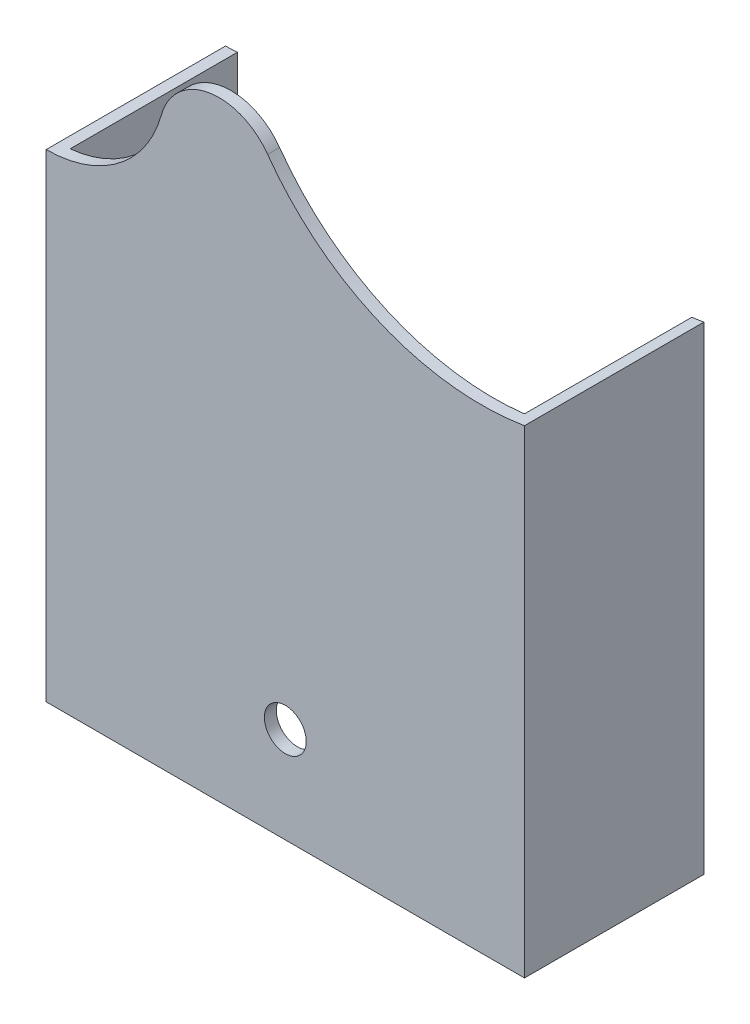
ISO-10303-21;
HEADER;
FILE_DESCRIPTION(('STEP AP214'),'2;1');
FILE_NAME('part.step','',(''),(''),'','','');
FILE_SCHEMA(('AUTOMOTIVE_DESIGN { 1 0 10303 214 1 1 1 1 }'));
ENDSEC;
DATA;
#1=APPLICATION_CONTEXT('core data for automotive mechanical design processes');
#2=APPLICATION_PROTOCOL_DEFINITION('international standard','automotive_design',2000,#1);
#3=PRODUCT_CONTEXT('',#1,'mechanical');
#4=PRODUCT('Part','Part','',(#3));
#5=PRODUCT_RELATED_PRODUCT_CATEGORY('part','',(#4));
#6=PRODUCT_DEFINITION_FORMATION('','',#4);
#7=PRODUCT_DEFINITION_CONTEXT('part definition',#1,'design');
#8=PRODUCT_DEFINITION('design','',#6,#7);
#9=PRODUCT_DEFINITION_SHAPE('','',#8);
#10=(LENGTH_UNIT() NAMED_UNIT(*) SI_UNIT(.MILLI.,.METRE.));
#11=(NAMED_UNIT(*) PLANE_ANGLE_UNIT() SI_UNIT($,.RADIAN.));
#12=(NAMED_UNIT(*) SI_UNIT($,.STERADIAN.) SOLID_ANGLE_UNIT());
#13=UNCERTAINTY_MEASURE_WITH_UNIT(LENGTH_MEASURE(1.E-05),#10,'distance_accuracy_value','');
#14=(GEOMETRIC_REPRESENTATION_CONTEXT(3) GLOBAL_UNCERTAINTY_ASSIGNED_CONTEXT((#13)) GLOBAL_UNIT_ASSIGNED_CONTEXT((#10,
#11,#12)) REPRESENTATION_CONTEXT('',''));
#15=CARTESIAN_POINT('',(0.,0.,0.));
#16=DIRECTION('',(0.,0.,1.));
#17=DIRECTION('',(1.,0.,0.));
#18=AXIS2_PLACEMENT_3D('',#15,#16,#17);
#19=CARTESIAN_POINT('',(0.,50.,0.));
#20=DIRECTION('',(0.,0.,1.));
#21=DIRECTION('',(1.,0.,0.));
#22=AXIS2_PLACEMENT_3D('',#19,#20,#21);
#23=PLANE('',#22);
#24=CARTESIAN_POINT('',(0.,50.,0.));
#25=DIRECTION('',(0.,0.,-1.));
#26=DIRECTION('',(1.,0.,0.));
#27=AXIS2_PLACEMENT_3D('',#24,#25,#26);
#28=CIRCLE('',#27,10.);
#29=CARTESIAN_POINT('',(1.,40.0501256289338,0.));
#30=VERTEX_POINT('',#29);
#31=CARTESIAN_POINT('',(0.,40.,0.));
#32=VERTEX_POINT('',#31);
#33=EDGE_CURVE('E75',#30,#32,#28,.T.);
#34=ORIENTED_EDGE('',*,*,#33,.F.);
#35=DIRECTION('',(0.,-1.,0.));
#36=VECTOR('',#35,1.);
#37=CARTESIAN_POINT('',(1.,50.,0.));
#38=LINE('',#37,#36);
#39=CARTESIAN_POINT('',(1.,0.,0.));
#40=VERTEX_POINT('',#39);
#41=EDGE_CURVE('E162',#30,#40,#38,.T.);
#42=ORIENTED_EDGE('',*,*,#41,.T.);
#43=DIRECTION('',(1.,0.,0.));
#44=VECTOR('',#43,1.);
#45=CARTESIAN_POINT('',(0.,0.,0.));
#46=LINE('',#45,#44);
#47=CARTESIAN_POINT('',(0.,0.,0.));
#48=VERTEX_POINT('',#47);
#49=EDGE_CURVE('E130',#48,#40,#46,.T.);
#50=ORIENTED_EDGE('',*,*,#49,.F.);
#51=DIRECTION('',(0.,-1.,0.));
#52=VECTOR('',#51,1.);
#53=CARTESIAN_POINT('',(0.,0.,0.));
#54=LINE('',#53,#52);
#55=EDGE_CURVE('E125',#32,#48,#54,.T.);
#56=ORIENTED_EDGE('',*,*,#55,.F.);
#57=EDGE_LOOP('',(#34,#42,#50,#56));
#58=FACE_BOUND('',#57,.T.);
#59=ADVANCED_FACE('F30',(#58),#23,.F.);
#60=CARTESIAN_POINT('',(0.,50.,15.));
#61=DIRECTION('',(0.,0.,1.));
#62=DIRECTION('',(1.,0.,0.));
#63=AXIS2_PLACEMENT_3D('',#60,#61,#62);
#64=PLANE('',#63);
#65=DIRECTION('',(0.,-1.,0.));
#66=VECTOR('',#65,1.);
#67=CARTESIAN_POINT('',(0.,0.,15.));
#68=LINE('',#67,#66);
#69=CARTESIAN_POINT('',(0.,40.,15.));
#70=VERTEX_POINT('',#69);
#71=CARTESIAN_POINT('',(0.,0.,15.));
#72=VERTEX_POINT('',#71);
#73=EDGE_CURVE('E139',#70,#72,#68,.T.);
#74=ORIENTED_EDGE('',*,*,#73,.T.);
#75=DIRECTION('',(1.,0.,0.));
#76=VECTOR('',#75,1.);
#77=CARTESIAN_POINT('',(0.,0.,15.));
#78=LINE('',#77,#76);
#79=CARTESIAN_POINT('',(40.,0.,15.));
#80=VERTEX_POINT('',#79);
#81=EDGE_CURVE('E84',#72,#80,#78,.T.);
#82=ORIENTED_EDGE('',*,*,#81,.T.);
#83=DIRECTION('',(0.,1.,0.));
#84=VECTOR('',#83,1.);
#85=CARTESIAN_POINT('',(40.,0.,15.));
#86=LINE('',#85,#84);
#87=CARTESIAN_POINT('',(40.,40.,15.));
#88=VERTEX_POINT('',#87);
#89=EDGE_CURVE('E101',#80,#88,#86,.T.);
#90=ORIENTED_EDGE('',*,*,#89,.T.);
#91=CARTESIAN_POINT('',(36.4183063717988,61.7064845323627,15.));
#92=DIRECTION('',(0.,0.,-1.));
#93=DIRECTION('',(1.,0.,0.));
#94=AXIS2_PLACEMENT_3D('',#91,#92,#93);
#95=CIRCLE('',#94,22.);
#96=CARTESIAN_POINT('',(18.5237719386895,48.9086082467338,15.));
#97=VERTEX_POINT('',#96);
#98=EDGE_CURVE('E93',#88,#97,#95,.T.);
#99=ORIENTED_EDGE('',*,*,#98,.T.);
#100=CARTESIAN_POINT('',(14.456832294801,46.,15.));
#101=DIRECTION('',(0.,0.,1.));
#102=DIRECTION('',(1.,0.,0.));
#103=AXIS2_PLACEMENT_3D('',#100,#101,#102);
#104=CIRCLE('',#103,5.);
#105=CARTESIAN_POINT('',(9.63788819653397,47.3333333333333,15.));
#106=VERTEX_POINT('',#105);
#107=EDGE_CURVE('E98',#97,#106,#104,.T.);
#108=ORIENTED_EDGE('',*,*,#107,.T.);
#109=CARTESIAN_POINT('',(0.,50.,15.));
#110=DIRECTION('',(0.,0.,-1.));
#111=DIRECTION('',(1.,0.,0.));
#112=AXIS2_PLACEMENT_3D('',#109,#110,#111);
#113=CIRCLE('',#112,10.);
#114=EDGE_CURVE('E54',#106,#70,#113,.T.);
#115=ORIENTED_EDGE('',*,*,#114,.T.);
#116=EDGE_LOOP('',(#74,#82,#90,#99,#108,#115));
#117=FACE_BOUND('',#116,.T.);
#118=CARTESIAN_POINT('',(20.,8.,15.));
#119=DIRECTION('',(0.,0.,1.));
#120=DIRECTION('',(1.,0.,0.));
#121=AXIS2_PLACEMENT_3D('',#118,#119,#120);
#122=CIRCLE('',#121,1.75);
#123=CARTESIAN_POINT('',(21.75,8.,15.));
#124=VERTEX_POINT('',#123);
#125=EDGE_CURVE('E129',#124,#124,#122,.T.);
#126=ORIENTED_EDGE('',*,*,#125,.F.);
#127=EDGE_LOOP('',(#126));
#128=FACE_BOUND('',#127,.T.);
#129=ADVANCED_FACE('F95',(#117,#128),#64,.T.);
#130=CARTESIAN_POINT('',(39.,0.,0.));
#131=VERTEX_POINT('',#130);
#132=CARTESIAN_POINT('',(40.,0.,0.));
#133=VERTEX_POINT('',#132);
#134=EDGE_CURVE('E128',#131,#133,#46,.T.);
#135=ORIENTED_EDGE('',*,*,#134,.F.);
#136=DIRECTION('',(0.,1.,0.));
#137=VECTOR('',#136,1.);
#138=CARTESIAN_POINT('',(39.,50.,0.));
#139=LINE('',#138,#137);
#140=CARTESIAN_POINT('',(39.,39.8584901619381,0.));
#141=VERTEX_POINT('',#140);
#142=EDGE_CURVE('E182',#131,#141,#139,.T.);
#143=ORIENTED_EDGE('',*,*,#142,.T.);
#144=CARTESIAN_POINT('',(36.4183063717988,61.7064845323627,0.));
#145=DIRECTION('',(0.,0.,-1.));
#146=DIRECTION('',(1.,0.,0.));
#147=AXIS2_PLACEMENT_3D('',#144,#145,#146);
#148=CIRCLE('',#147,22.);
#149=CARTESIAN_POINT('',(40.,40.,0.));
#150=VERTEX_POINT('',#149);
#151=EDGE_CURVE('E135',#150,#141,#148,.T.);
#152=ORIENTED_EDGE('',*,*,#151,.F.);
#153=DIRECTION('',(0.,1.,0.));
#154=VECTOR('',#153,1.);
#155=CARTESIAN_POINT('',(40.,0.,0.));
#156=LINE('',#155,#154);
#157=EDGE_CURVE('E133',#133,#150,#156,.T.);
#158=ORIENTED_EDGE('',*,*,#157,.F.);
#159=EDGE_LOOP('',(#135,#143,#152,#158));
#160=FACE_BOUND('',#159,.T.);
#161=ADVANCED_FACE('F191',(#160),#23,.F.);
#162=CARTESIAN_POINT('',(0.,0.,15.));
#163=DIRECTION('',(1.,0.,0.));
#164=DIRECTION('',(0.,0.,-1.));
#165=AXIS2_PLACEMENT_3D('',#162,#163,#164);
#166=PLANE('',#165);
#167=ORIENTED_EDGE('',*,*,#55,.T.);
#168=DIRECTION('',(0.,0.,-1.));
#169=VECTOR('',#168,1.);
#170=CARTESIAN_POINT('',(0.,0.,15.));
#171=LINE('',#170,#169);
#172=EDGE_CURVE('E146',#72,#48,#171,.T.);
#173=ORIENTED_EDGE('',*,*,#172,.F.);
#174=ORIENTED_EDGE('',*,*,#73,.F.);
#175=DIRECTION('',(0.,0.,-1.));
#176=VECTOR('',#175,1.);
#177=CARTESIAN_POINT('',(0.,40.,15.));
#178=LINE('',#177,#176);
#179=EDGE_CURVE('E121',#70,#32,#178,.T.);
#180=ORIENTED_EDGE('',*,*,#179,.T.);
#181=EDGE_LOOP('',(#167,#173,#174,#180));
#182=FACE_BOUND('',#181,.T.);
#183=ADVANCED_FACE('F32',(#182),#166,.F.);
#184=CARTESIAN_POINT('',(0.,0.,15.));
#185=DIRECTION('',(0.,1.,0.));
#186=DIRECTION('',(0.,0.,1.));
#187=AXIS2_PLACEMENT_3D('',#184,#185,#186);
#188=PLANE('',#187);
#189=ORIENTED_EDGE('',*,*,#49,.T.);
#190=DIRECTION('',(0.,0.,-1.));
#191=VECTOR('',#190,1.);
#192=CARTESIAN_POINT('',(1.,0.,14.));
#193=LINE('',#192,#191);
#194=CARTESIAN_POINT('',(1.,0.,14.));
#195=VERTEX_POINT('',#194);
#196=EDGE_CURVE('E203',#195,#40,#193,.T.);
#197=ORIENTED_EDGE('',*,*,#196,.F.);
#198=DIRECTION('',(-1.,0.,0.));
#199=VECTOR('',#198,1.);
#200=CARTESIAN_POINT('',(39.,0.,14.));
#201=LINE('',#200,#199);
#202=CARTESIAN_POINT('',(39.,0.,14.));
#203=VERTEX_POINT('',#202);
#204=EDGE_CURVE('E201',#203,#195,#201,.T.);
#205=ORIENTED_EDGE('',*,*,#204,.F.);
#206=DIRECTION('',(0.,0.,1.));
#207=VECTOR('',#206,1.);
#208=CARTESIAN_POINT('',(39.,0.,-3.67141872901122));
#209=LINE('',#208,#207);
#210=EDGE_CURVE('E198',#131,#203,#209,.T.);
#211=ORIENTED_EDGE('',*,*,#210,.F.);
#212=ORIENTED_EDGE('',*,*,#134,.T.);
#213=DIRECTION('',(0.,0.,-1.));
#214=VECTOR('',#213,1.);
#215=CARTESIAN_POINT('',(40.,0.,15.));
#216=LINE('',#215,#214);
#217=EDGE_CURVE('E143',#80,#133,#216,.T.);
#218=ORIENTED_EDGE('',*,*,#217,.F.);
#219=ORIENTED_EDGE('',*,*,#81,.F.);
#220=ORIENTED_EDGE('',*,*,#172,.T.);
#221=EDGE_LOOP('',(#189,#197,#205,#211,#212,#218,#219,#220));
#222=FACE_BOUND('',#221,.T.);
#223=ADVANCED_FACE('F196',(#222),#188,.F.);
#224=CARTESIAN_POINT('',(40.,0.,15.));
#225=DIRECTION('',(-1.,0.,0.));
#226=DIRECTION('',(0.,0.,1.));
#227=AXIS2_PLACEMENT_3D('',#224,#225,#226);
#228=PLANE('',#227);
#229=ORIENTED_EDGE('',*,*,#157,.T.);
#230=DIRECTION('',(0.,0.,-1.));
#231=VECTOR('',#230,1.);
#232=CARTESIAN_POINT('',(40.,40.,15.));
#233=LINE('',#232,#231);
#234=EDGE_CURVE('E115',#88,#150,#233,.T.);
#235=ORIENTED_EDGE('',*,*,#234,.F.);
#236=ORIENTED_EDGE('',*,*,#89,.F.);
#237=ORIENTED_EDGE('',*,*,#217,.T.);
#238=EDGE_LOOP('',(#229,#235,#236,#237));
#239=FACE_BOUND('',#238,.T.);
#240=ADVANCED_FACE('F195',(#239),#228,.F.);
#241=CARTESIAN_POINT('',(36.4183063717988,61.7064845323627,15.));
#242=DIRECTION('',(0.,0.,-1.));
#243=DIRECTION('',(-1.,0.,0.));
#244=AXIS2_PLACEMENT_3D('',#241,#242,#243);
#245=CYLINDRICAL_SURFACE('',#244,22.);
#246=DIRECTION('',(0.,0.,-1.));
#247=VECTOR('',#246,1.);
#248=CARTESIAN_POINT('',(39.,39.8584901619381,15.));
#249=LINE('',#248,#247);
#250=CARTESIAN_POINT('',(39.,39.8584901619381,14.));
#251=VERTEX_POINT('',#250);
#252=EDGE_CURVE('E11',#141,#251,#249,.F.);
#253=ORIENTED_EDGE('',*,*,#252,.T.);
#254=CARTESIAN_POINT('',(36.4183063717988,61.7064845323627,14.));
#255=DIRECTION('',(0.,0.,1.));
#256=DIRECTION('',(1.,0.,0.));
#257=AXIS2_PLACEMENT_3D('',#254,#255,#256);
#258=CIRCLE('',#257,22.);
#259=CARTESIAN_POINT('',(18.5237719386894,48.9086082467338,14.));
#260=VERTEX_POINT('',#259);
#261=EDGE_CURVE('E112',#251,#260,#258,.F.);
#262=ORIENTED_EDGE('',*,*,#261,.T.);
#263=DIRECTION('',(0.,0.,-1.));
#264=VECTOR('',#263,1.);
#265=CARTESIAN_POINT('',(18.5237719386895,48.9086082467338,15.));
#266=LINE('',#265,#264);
#267=EDGE_CURVE('E108',#97,#260,#266,.T.);
#268=ORIENTED_EDGE('',*,*,#267,.F.);
#269=ORIENTED_EDGE('',*,*,#98,.F.);
#270=ORIENTED_EDGE('',*,*,#234,.T.);
#271=ORIENTED_EDGE('',*,*,#151,.T.);
#272=EDGE_LOOP('',(#253,#262,#268,#269,#270,#271));
#273=FACE_BOUND('',#272,.T.);
#274=ADVANCED_FACE('F109',(#273),#245,.F.);
#275=CARTESIAN_POINT('',(14.456832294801,46.,15.));
#276=DIRECTION('',(0.,0.,-1.));
#277=DIRECTION('',(-1.,0.,0.));
#278=AXIS2_PLACEMENT_3D('',#275,#276,#277);
#279=CYLINDRICAL_SURFACE('',#278,5.);
#280=CARTESIAN_POINT('',(14.456832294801,46.,14.));
#281=DIRECTION('',(0.,0.,1.));
#282=DIRECTION('',(1.,0.,0.));
#283=AXIS2_PLACEMENT_3D('',#280,#281,#282);
#284=CIRCLE('',#283,5.);
#285=CARTESIAN_POINT('',(9.63788819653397,47.3333333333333,14.));
#286=VERTEX_POINT('',#285);
#287=EDGE_CURVE('E170',#260,#286,#284,.T.);
#288=ORIENTED_EDGE('',*,*,#287,.T.);
#289=DIRECTION('',(0.,0.,-1.));
#290=VECTOR('',#289,1.);
#291=CARTESIAN_POINT('',(9.63788819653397,47.3333333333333,15.));
#292=LINE('',#291,#290);
#293=EDGE_CURVE('E116',#106,#286,#292,.T.);
#294=ORIENTED_EDGE('',*,*,#293,.F.);
#295=ORIENTED_EDGE('',*,*,#107,.F.);
#296=ORIENTED_EDGE('',*,*,#267,.T.);
#297=EDGE_LOOP('',(#288,#294,#295,#296));
#298=FACE_BOUND('',#297,.T.);
#299=ADVANCED_FACE('F118',(#298),#279,.T.);
#300=CARTESIAN_POINT('',(0.,50.,15.));
#301=DIRECTION('',(0.,0.,-1.));
#302=DIRECTION('',(-1.,0.,0.));
#303=AXIS2_PLACEMENT_3D('',#300,#301,#302);
#304=CYLINDRICAL_SURFACE('',#303,10.);
#305=CARTESIAN_POINT('',(0.,50.,14.));
#306=DIRECTION('',(0.,0.,1.));
#307=DIRECTION('',(1.,0.,0.));
#308=AXIS2_PLACEMENT_3D('',#305,#306,#307);
#309=CIRCLE('',#308,10.);
#310=CARTESIAN_POINT('',(1.,40.0501256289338,14.));
#311=VERTEX_POINT('',#310);
#312=EDGE_CURVE('E150',#286,#311,#309,.F.);
#313=ORIENTED_EDGE('',*,*,#312,.T.);
#314=DIRECTION('',(0.,0.,-1.));
#315=VECTOR('',#314,1.);
#316=CARTESIAN_POINT('',(1.,40.0501256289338,15.));
#317=LINE('',#316,#315);
#318=EDGE_CURVE('E38',#311,#30,#317,.T.);
#319=ORIENTED_EDGE('',*,*,#318,.T.);
#320=ORIENTED_EDGE('',*,*,#33,.T.);
#321=ORIENTED_EDGE('',*,*,#179,.F.);
#322=ORIENTED_EDGE('',*,*,#114,.F.);
#323=ORIENTED_EDGE('',*,*,#293,.T.);
#324=EDGE_LOOP('',(#313,#319,#320,#321,#322,#323));
#325=FACE_BOUND('',#324,.T.);
#326=ADVANCED_FACE('F153',(#325),#304,.F.);
#327=CARTESIAN_POINT('',(20.,8.,15.));
#328=DIRECTION('',(0.,0.,-1.));
#329=DIRECTION('',(-1.,0.,0.));
#330=AXIS2_PLACEMENT_3D('',#327,#328,#329);
#331=CYLINDRICAL_SURFACE('',#330,1.75);
#332=CARTESIAN_POINT('',(20.,8.,14.));
#333=DIRECTION('',(0.,0.,1.));
#334=DIRECTION('',(1.,0.,0.));
#335=AXIS2_PLACEMENT_3D('',#332,#333,#334);
#336=CIRCLE('',#335,1.75);
#337=CARTESIAN_POINT('',(21.75,8.,14.));
#338=VERTEX_POINT('',#337);
#339=EDGE_CURVE('E148',#338,#338,#336,.T.);
#340=ORIENTED_EDGE('',*,*,#339,.F.);
#341=EDGE_LOOP('',(#340));
#342=FACE_BOUND('',#341,.T.);
#343=ORIENTED_EDGE('',*,*,#125,.T.);
#344=EDGE_LOOP('',(#343));
#345=FACE_BOUND('',#344,.T.);
#346=ADVANCED_FACE('F218',(#342,#345),#331,.F.);
#347=CARTESIAN_POINT('',(39.,51.,-3.67141872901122));
#348=DIRECTION('',(1.,0.,0.));
#349=DIRECTION('',(0.,0.,-1.));
#350=AXIS2_PLACEMENT_3D('',#347,#348,#349);
#351=PLANE('',#350);
#352=ORIENTED_EDGE('',*,*,#210,.T.);
#353=DIRECTION('',(0.,-1.,0.));
#354=VECTOR('',#353,1.);
#355=CARTESIAN_POINT('',(39.,51.,14.));
#356=LINE('',#355,#354);
#357=EDGE_CURVE('E187',#251,#203,#356,.T.);
#358=ORIENTED_EDGE('',*,*,#357,.F.);
#359=ORIENTED_EDGE('',*,*,#252,.F.);
#360=ORIENTED_EDGE('',*,*,#142,.F.);
#361=EDGE_LOOP('',(#352,#358,#359,#360));
#362=FACE_BOUND('',#361,.T.);
#363=ADVANCED_FACE('F185',(#362),#351,.F.);
#364=CARTESIAN_POINT('',(1.,51.,14.));
#365=DIRECTION('',(-1.,0.,0.));
#366=DIRECTION('',(0.,0.,1.));
#367=AXIS2_PLACEMENT_3D('',#364,#365,#366);
#368=PLANE('',#367);
#369=ORIENTED_EDGE('',*,*,#318,.F.);
#370=DIRECTION('',(0.,-1.,0.));
#371=VECTOR('',#370,1.);
#372=CARTESIAN_POINT('',(1.,51.,14.));
#373=LINE('',#372,#371);
#374=EDGE_CURVE('E45',#311,#195,#373,.T.);
#375=ORIENTED_EDGE('',*,*,#374,.T.);
#376=ORIENTED_EDGE('',*,*,#196,.T.);
#377=ORIENTED_EDGE('',*,*,#41,.F.);
#378=EDGE_LOOP('',(#369,#375,#376,#377));
#379=FACE_BOUND('',#378,.T.);
#380=ADVANCED_FACE('F291',(#379),#368,.F.);
#381=CARTESIAN_POINT('',(39.,51.,14.));
#382=DIRECTION('',(0.,0.,1.));
#383=DIRECTION('',(1.,0.,0.));
#384=AXIS2_PLACEMENT_3D('',#381,#382,#383);
#385=PLANE('',#384);
#386=ORIENTED_EDGE('',*,*,#339,.T.);
#387=EDGE_LOOP('',(#386));
#388=FACE_BOUND('',#387,.T.);
#389=ORIENTED_EDGE('',*,*,#357,.T.);
#390=ORIENTED_EDGE('',*,*,#204,.T.);
#391=ORIENTED_EDGE('',*,*,#374,.F.);
#392=ORIENTED_EDGE('',*,*,#312,.F.);
#393=ORIENTED_EDGE('',*,*,#287,.F.);
#394=ORIENTED_EDGE('',*,*,#261,.F.);
#395=EDGE_LOOP('',(#389,#390,#391,#392,#393,#394));
#396=FACE_BOUND('',#395,.T.);
#397=ADVANCED_FACE('F299',(#388,#396),#385,.F.);
#398=CLOSED_SHELL('',(#59,#129,#161,#183,#223,#240,#274,#299,#326,#346,#363,#380,#397));
#399=MANIFOLD_SOLID_BREP('B2',#398);
#400=ADVANCED_BREP_SHAPE_REPRESENTATION('',(#18,#399),#14);
#401=SHAPE_DEFINITION_REPRESENTATION(#9,#400);
ENDSEC;
END-ISO-10303-21;
